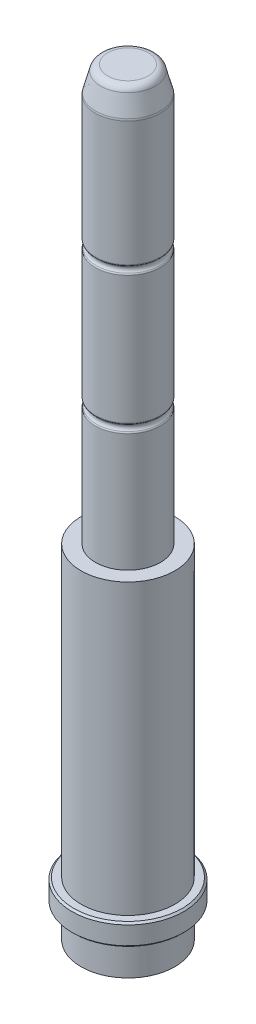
ISO-10303-21;
HEADER;
FILE_DESCRIPTION(('STEP AP214'),'2;1');
FILE_NAME('part.step','',(''),(''),'','','');
FILE_SCHEMA(('AUTOMOTIVE_DESIGN { 1 0 10303 214 1 1 1 1 }'));
ENDSEC;
DATA;
#1=APPLICATION_CONTEXT('core data for automotive mechanical design processes');
#2=APPLICATION_PROTOCOL_DEFINITION('international standard','automotive_design',2000,#1);
#3=PRODUCT_CONTEXT('',#1,'mechanical');
#4=PRODUCT('Part','Part','',(#3));
#5=PRODUCT_RELATED_PRODUCT_CATEGORY('part','',(#4));
#6=PRODUCT_DEFINITION_FORMATION('','',#4);
#7=PRODUCT_DEFINITION_CONTEXT('part definition',#1,'design');
#8=PRODUCT_DEFINITION('design','',#6,#7);
#9=PRODUCT_DEFINITION_SHAPE('','',#8);
#10=(LENGTH_UNIT() NAMED_UNIT(*) SI_UNIT(.MILLI.,.METRE.));
#11=(NAMED_UNIT(*) PLANE_ANGLE_UNIT() SI_UNIT($,.RADIAN.));
#12=(NAMED_UNIT(*) SI_UNIT($,.STERADIAN.) SOLID_ANGLE_UNIT());
#13=UNCERTAINTY_MEASURE_WITH_UNIT(LENGTH_MEASURE(1.E-05),#10,'distance_accuracy_value','');
#14=(GEOMETRIC_REPRESENTATION_CONTEXT(3) GLOBAL_UNCERTAINTY_ASSIGNED_CONTEXT((#13)) GLOBAL_UNIT_ASSIGNED_CONTEXT((#10,
#11,#12)) REPRESENTATION_CONTEXT('',''));
#15=CARTESIAN_POINT('',(0.,0.,0.));
#16=DIRECTION('',(0.,0.,1.));
#17=DIRECTION('',(1.,0.,0.));
#18=AXIS2_PLACEMENT_3D('',#15,#16,#17);
#19=CARTESIAN_POINT('',(0.,6.,0.));
#20=DIRECTION('',(0.,-1.,0.));
#21=DIRECTION('',(0.,0.,-1.));
#22=AXIS2_PLACEMENT_3D('',#19,#20,#21);
#23=CYLINDRICAL_SURFACE('',#22,15.5);
#24=CARTESIAN_POINT('',(0.,5.5,0.));
#25=DIRECTION('',(0.,1.,0.));
#26=DIRECTION('',(0.,0.,1.));
#27=AXIS2_PLACEMENT_3D('',#24,#25,#26);
#28=CIRCLE('',#27,15.5);
#29=CARTESIAN_POINT('',(0.,5.5,15.5));
#30=VERTEX_POINT('',#29);
#31=EDGE_CURVE('E22',#30,#30,#28,.F.);
#32=ORIENTED_EDGE('',*,*,#31,.T.);
#33=EDGE_LOOP('',(#32));
#34=FACE_BOUND('',#33,.T.);
#35=CARTESIAN_POINT('',(0.,0.499999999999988,0.));
#36=DIRECTION('',(0.,1.,0.));
#37=DIRECTION('',(0.,0.,1.));
#38=AXIS2_PLACEMENT_3D('',#35,#36,#37);
#39=CIRCLE('',#38,15.5);
#40=CARTESIAN_POINT('',(0.,0.499999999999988,15.5));
#41=VERTEX_POINT('',#40);
#42=EDGE_CURVE('E30',#41,#41,#39,.T.);
#43=ORIENTED_EDGE('',*,*,#42,.T.);
#44=EDGE_LOOP('',(#43));
#45=FACE_BOUND('',#44,.T.);
#46=ADVANCED_FACE('F14',(#34,#45),#23,.T.);
#47=CARTESIAN_POINT('',(0.,6.,0.));
#48=DIRECTION('',(0.,1.,0.));
#49=DIRECTION('',(0.,0.,1.));
#50=AXIS2_PLACEMENT_3D('',#47,#48,#49);
#51=PLANE('',#50);
#52=CARTESIAN_POINT('',(0.,6.,0.));
#53=DIRECTION('',(0.,1.,0.));
#54=DIRECTION('',(0.,0.,1.));
#55=AXIS2_PLACEMENT_3D('',#52,#53,#54);
#56=CIRCLE('',#55,15.);
#57=CARTESIAN_POINT('',(0.,6.,15.));
#58=VERTEX_POINT('',#57);
#59=EDGE_CURVE('E37',#58,#58,#56,.T.);
#60=ORIENTED_EDGE('',*,*,#59,.T.);
#61=EDGE_LOOP('',(#60));
#62=FACE_BOUND('',#61,.T.);
#63=CARTESIAN_POINT('',(0.,6.,0.));
#64=DIRECTION('',(0.,-1.,0.));
#65=DIRECTION('',(0.,0.,-1.));
#66=AXIS2_PLACEMENT_3D('',#63,#64,#65);
#67=CIRCLE('',#66,13.);
#68=CARTESIAN_POINT('',(0.,6.,-13.));
#69=VERTEX_POINT('',#68);
#70=EDGE_CURVE('E47',#69,#69,#67,.T.);
#71=ORIENTED_EDGE('',*,*,#70,.T.);
#72=EDGE_LOOP('',(#71));
#73=FACE_BOUND('',#72,.T.);
#74=ADVANCED_FACE('F125',(#62,#73),#51,.T.);
#75=CARTESIAN_POINT('',(0.,0.,0.));
#76=DIRECTION('',(0.,1.,0.));
#77=DIRECTION('',(0.,0.,1.));
#78=AXIS2_PLACEMENT_3D('',#75,#76,#77);
#79=PLANE('',#78);
#80=CARTESIAN_POINT('',(0.,0.,0.));
#81=DIRECTION('',(0.,1.,0.));
#82=DIRECTION('',(0.,0.,1.));
#83=AXIS2_PLACEMENT_3D('',#80,#81,#82);
#84=CIRCLE('',#83,15.);
#85=CARTESIAN_POINT('',(0.,0.,15.));
#86=VERTEX_POINT('',#85);
#87=EDGE_CURVE('E9',#86,#86,#84,.F.);
#88=ORIENTED_EDGE('',*,*,#87,.T.);
#89=EDGE_LOOP('',(#88));
#90=FACE_BOUND('',#89,.T.);
#91=CARTESIAN_POINT('',(0.,0.,0.));
#92=DIRECTION('',(0.,1.,0.));
#93=DIRECTION('',(0.,0.,1.));
#94=AXIS2_PLACEMENT_3D('',#91,#92,#93);
#95=CIRCLE('',#94,13.);
#96=CARTESIAN_POINT('',(0.,0.,13.));
#97=VERTEX_POINT('',#96);
#98=EDGE_CURVE('E104',#97,#97,#95,.T.);
#99=ORIENTED_EDGE('',*,*,#98,.T.);
#100=EDGE_LOOP('',(#99));
#101=FACE_BOUND('',#100,.T.);
#102=ADVANCED_FACE('F108',(#90,#101),#79,.F.);
#103=CARTESIAN_POINT('',(0.,86.,0.));
#104=DIRECTION('',(0.,-1.,0.));
#105=DIRECTION('',(0.,0.,-1.));
#106=AXIS2_PLACEMENT_3D('',#103,#104,#105);
#107=PLANE('',#106);
#108=CARTESIAN_POINT('',(0.,86.,0.));
#109=DIRECTION('',(0.,1.,0.));
#110=DIRECTION('',(0.,0.,1.));
#111=AXIS2_PLACEMENT_3D('',#108,#109,#110);
#112=CIRCLE('',#111,9.);
#113=CARTESIAN_POINT('',(0.,86.,8.99999999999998));
#114=VERTEX_POINT('',#113);
#115=EDGE_CURVE('E43',#114,#114,#112,.T.);
#116=ORIENTED_EDGE('',*,*,#115,.F.);
#117=EDGE_LOOP('',(#116));
#118=FACE_BOUND('',#117,.T.);
#119=CARTESIAN_POINT('',(0.,86.,0.));
#120=DIRECTION('',(0.,-1.,0.));
#121=DIRECTION('',(0.,0.,-1.));
#122=AXIS2_PLACEMENT_3D('',#119,#120,#121);
#123=CIRCLE('',#122,13.);
#124=CARTESIAN_POINT('',(0.,86.,-13.));
#125=VERTEX_POINT('',#124);
#126=EDGE_CURVE('E44',#125,#125,#123,.T.);
#127=ORIENTED_EDGE('',*,*,#126,.F.);
#128=EDGE_LOOP('',(#127));
#129=FACE_BOUND('',#128,.T.);
#130=ADVANCED_FACE('F134',(#118,#129),#107,.F.);
#131=CARTESIAN_POINT('',(0.,6.,0.));
#132=DIRECTION('',(0.,-1.,0.));
#133=DIRECTION('',(0.,0.,-1.));
#134=AXIS2_PLACEMENT_3D('',#131,#132,#133);
#135=CYLINDRICAL_SURFACE('',#134,13.);
#136=ORIENTED_EDGE('',*,*,#70,.F.);
#137=EDGE_LOOP('',(#136));
#138=FACE_BOUND('',#137,.T.);
#139=ORIENTED_EDGE('',*,*,#126,.T.);
#140=EDGE_LOOP('',(#139));
#141=FACE_BOUND('',#140,.T.);
#142=ADVANCED_FACE('F138',(#138,#141),#135,.T.);
#143=CARTESIAN_POINT('',(0.,201.,0.));
#144=DIRECTION('',(0.,1.,0.));
#145=DIRECTION('',(0.,0.,1.));
#146=AXIS2_PLACEMENT_3D('',#143,#144,#145);
#147=PLANE('',#146);
#148=CARTESIAN_POINT('',(0.,201.,0.));
#149=DIRECTION('',(0.,1.,0.));
#150=DIRECTION('',(0.,0.,1.));
#151=AXIS2_PLACEMENT_3D('',#148,#149,#150);
#152=CIRCLE('',#151,5.5897016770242);
#153=CARTESIAN_POINT('',(0.,201.,5.5897016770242));
#154=VERTEX_POINT('',#153);
#155=EDGE_CURVE('E51',#154,#154,#152,.T.);
#156=ORIENTED_EDGE('',*,*,#155,.T.);
#157=EDGE_LOOP('',(#156));
#158=FACE_BOUND('',#157,.T.);
#159=ADVANCED_FACE('F142',(#158),#147,.T.);
#160=CARTESIAN_POINT('',(0.,199.,0.));
#161=DIRECTION('',(0.,1.,0.));
#162=DIRECTION('',(0.,0.,1.));
#163=AXIS2_PLACEMENT_3D('',#160,#161,#162);
#164=TOROIDAL_SURFACE('',#163,5.5897016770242,2.);
#165=CARTESIAN_POINT('',(0.,199.517638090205,0.));
#166=DIRECTION('',(0.,1.,0.));
#167=DIRECTION('',(0.,0.,1.));
#168=AXIS2_PLACEMENT_3D('',#165,#166,#167);
#169=CIRCLE('',#168,7.52155332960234);
#170=CARTESIAN_POINT('',(0.,199.517638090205,7.52155332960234));
#171=VERTEX_POINT('',#170);
#172=EDGE_CURVE('E55',#171,#171,#169,.T.);
#173=ORIENTED_EDGE('',*,*,#172,.T.);
#174=EDGE_LOOP('',(#173));
#175=FACE_BOUND('',#174,.T.);
#176=ORIENTED_EDGE('',*,*,#155,.F.);
#177=EDGE_LOOP('',(#176));
#178=FACE_BOUND('',#177,.T.);
#179=ADVANCED_FACE('F146',(#175,#178),#164,.T.);
#180=CARTESIAN_POINT('',(0.,199.517638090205,0.));
#181=DIRECTION('',(0.,-1.,0.));
#182=DIRECTION('',(0.,0.,-1.));
#183=AXIS2_PLACEMENT_3D('',#180,#181,#182);
#184=CONICAL_SURFACE('',#183,7.52155332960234,0.261799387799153);
#185=CARTESIAN_POINT('',(0.,194.254333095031,0.));
#186=DIRECTION('',(0.,1.,0.));
#187=DIRECTION('',(0.,0.,1.));
#188=AXIS2_PLACEMENT_3D('',#185,#186,#187);
#189=CIRCLE('',#188,8.93185165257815);
#190=CARTESIAN_POINT('',(0.,194.254333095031,8.93185165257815));
#191=VERTEX_POINT('',#190);
#192=EDGE_CURVE('E58',#191,#191,#189,.T.);
#193=ORIENTED_EDGE('',*,*,#192,.T.);
#194=EDGE_LOOP('',(#193));
#195=FACE_BOUND('',#194,.T.);
#196=ORIENTED_EDGE('',*,*,#172,.F.);
#197=EDGE_LOOP('',(#196));
#198=FACE_BOUND('',#197,.T.);
#199=ADVANCED_FACE('F150',(#195,#198),#184,.T.);
#200=CARTESIAN_POINT('',(0.,193.736695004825,0.));
#201=DIRECTION('',(0.,1.,0.));
#202=DIRECTION('',(0.,0.,1.));
#203=AXIS2_PLACEMENT_3D('',#200,#201,#202);
#204=TOROIDAL_SURFACE('',#203,7.,2.);
#205=CARTESIAN_POINT('',(0.,193.736695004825,0.));
#206=DIRECTION('',(0.,1.,0.));
#207=DIRECTION('',(0.,0.,1.));
#208=AXIS2_PLACEMENT_3D('',#205,#206,#207);
#209=CIRCLE('',#208,9.);
#210=CARTESIAN_POINT('',(0.,193.736695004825,9.));
#211=VERTEX_POINT('',#210);
#212=EDGE_CURVE('E62',#211,#211,#209,.T.);
#213=ORIENTED_EDGE('',*,*,#212,.T.);
#214=EDGE_LOOP('',(#213));
#215=FACE_BOUND('',#214,.T.);
#216=ORIENTED_EDGE('',*,*,#192,.F.);
#217=EDGE_LOOP('',(#216));
#218=FACE_BOUND('',#217,.T.);
#219=ADVANCED_FACE('F154',(#215,#218),#204,.T.);
#220=CARTESIAN_POINT('',(0.,201.,0.));
#221=DIRECTION('',(0.,1.,0.));
#222=DIRECTION('',(0.,0.,1.));
#223=AXIS2_PLACEMENT_3D('',#220,#221,#222);
#224=CYLINDRICAL_SURFACE('',#223,9.);
#225=CARTESIAN_POINT('',(0.,159.272019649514,0.));
#226=DIRECTION('',(0.,1.,0.));
#227=DIRECTION('',(0.,0.,1.));
#228=AXIS2_PLACEMENT_3D('',#225,#226,#227);
#229=CIRCLE('',#228,9.);
#230=CARTESIAN_POINT('',(0.,159.272019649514,9.));
#231=VERTEX_POINT('',#230);
#232=EDGE_CURVE('E66',#231,#231,#229,.T.);
#233=ORIENTED_EDGE('',*,*,#232,.T.);
#234=EDGE_LOOP('',(#233));
#235=FACE_BOUND('',#234,.T.);
#236=ORIENTED_EDGE('',*,*,#212,.F.);
#237=EDGE_LOOP('',(#236));
#238=FACE_BOUND('',#237,.T.);
#239=ADVANCED_FACE('F158',(#235,#238),#224,.T.);
#240=CARTESIAN_POINT('',(0.,159.272019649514,0.));
#241=DIRECTION('',(0.,1.,0.));
#242=DIRECTION('',(0.,0.,1.));
#243=AXIS2_PLACEMENT_3D('',#240,#241,#242);
#244=TOROIDAL_SURFACE('',#243,8.5,0.5);
#245=CARTESIAN_POINT('',(0.,158.878943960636,0.));
#246=DIRECTION('',(0.,1.,0.));
#247=DIRECTION('',(0.,0.,1.));
#248=AXIS2_PLACEMENT_3D('',#245,#246,#247);
#249=CIRCLE('',#248,8.80901699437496);
#250=CARTESIAN_POINT('',(0.,158.878943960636,8.80901699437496));
#251=VERTEX_POINT('',#250);
#252=EDGE_CURVE('E70',#251,#251,#249,.T.);
#253=ORIENTED_EDGE('',*,*,#252,.T.);
#254=EDGE_LOOP('',(#253));
#255=FACE_BOUND('',#254,.T.);
#256=ORIENTED_EDGE('',*,*,#232,.F.);
#257=EDGE_LOOP('',(#256));
#258=FACE_BOUND('',#257,.T.);
#259=ADVANCED_FACE('F162',(#255,#258),#244,.T.);
#260=CARTESIAN_POINT('',(0.,158.,0.));
#261=DIRECTION('',(0.,1.,0.));
#262=DIRECTION('',(0.,0.,1.));
#263=AXIS2_PLACEMENT_3D('',#260,#261,#262);
#264=TOROIDAL_SURFACE('',#263,9.5,1.11803398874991);
#265=CARTESIAN_POINT('',(0.,157.121056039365,0.));
#266=DIRECTION('',(0.,1.,0.));
#267=DIRECTION('',(0.,0.,1.));
#268=AXIS2_PLACEMENT_3D('',#265,#266,#267);
#269=CIRCLE('',#268,8.80901699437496);
#270=CARTESIAN_POINT('',(0.,157.121056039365,8.80901699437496));
#271=VERTEX_POINT('',#270);
#272=EDGE_CURVE('E74',#271,#271,#269,.T.);
#273=ORIENTED_EDGE('',*,*,#272,.T.);
#274=EDGE_LOOP('',(#273));
#275=FACE_BOUND('',#274,.T.);
#276=ORIENTED_EDGE('',*,*,#252,.F.);
#277=EDGE_LOOP('',(#276));
#278=FACE_BOUND('',#277,.T.);
#279=ADVANCED_FACE('F166',(#275,#278),#264,.F.);
#280=CARTESIAN_POINT('',(0.,156.727980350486,0.));
#281=DIRECTION('',(0.,1.,0.));
#282=DIRECTION('',(0.,0.,1.));
#283=AXIS2_PLACEMENT_3D('',#280,#281,#282);
#284=TOROIDAL_SURFACE('',#283,8.5,0.5);
#285=CARTESIAN_POINT('',(0.,156.727980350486,0.));
#286=DIRECTION('',(0.,1.,0.));
#287=DIRECTION('',(0.,0.,1.));
#288=AXIS2_PLACEMENT_3D('',#285,#286,#287);
#289=CIRCLE('',#288,9.);
#290=CARTESIAN_POINT('',(0.,156.727980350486,8.99999999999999));
#291=VERTEX_POINT('',#290);
#292=EDGE_CURVE('E78',#291,#291,#289,.T.);
#293=ORIENTED_EDGE('',*,*,#292,.T.);
#294=EDGE_LOOP('',(#293));
#295=FACE_BOUND('',#294,.T.);
#296=ORIENTED_EDGE('',*,*,#272,.F.);
#297=EDGE_LOOP('',(#296));
#298=FACE_BOUND('',#297,.T.);
#299=ADVANCED_FACE('F170',(#295,#298),#284,.T.);
#300=CARTESIAN_POINT('',(0.,201.,0.));
#301=DIRECTION('',(0.,1.,0.));
#302=DIRECTION('',(0.,0.,1.));
#303=AXIS2_PLACEMENT_3D('',#300,#301,#302);
#304=CYLINDRICAL_SURFACE('',#303,9.);
#305=CARTESIAN_POINT('',(0.,121.272019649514,0.));
#306=DIRECTION('',(0.,1.,0.));
#307=DIRECTION('',(0.,0.,1.));
#308=AXIS2_PLACEMENT_3D('',#305,#306,#307);
#309=CIRCLE('',#308,9.);
#310=CARTESIAN_POINT('',(0.,121.272019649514,8.99999999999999));
#311=VERTEX_POINT('',#310);
#312=EDGE_CURVE('E82',#311,#311,#309,.T.);
#313=ORIENTED_EDGE('',*,*,#312,.T.);
#314=EDGE_LOOP('',(#313));
#315=FACE_BOUND('',#314,.T.);
#316=ORIENTED_EDGE('',*,*,#292,.F.);
#317=EDGE_LOOP('',(#316));
#318=FACE_BOUND('',#317,.T.);
#319=ADVANCED_FACE('F174',(#315,#318),#304,.T.);
#320=CARTESIAN_POINT('',(0.,121.272019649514,0.));
#321=DIRECTION('',(0.,1.,0.));
#322=DIRECTION('',(0.,0.,1.));
#323=AXIS2_PLACEMENT_3D('',#320,#321,#322);
#324=TOROIDAL_SURFACE('',#323,8.5,0.5);
#325=CARTESIAN_POINT('',(0.,120.878943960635,0.));
#326=DIRECTION('',(0.,1.,0.));
#327=DIRECTION('',(0.,0.,1.));
#328=AXIS2_PLACEMENT_3D('',#325,#326,#327);
#329=CIRCLE('',#328,8.80901699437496);
#330=CARTESIAN_POINT('',(0.,120.878943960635,8.80901699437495));
#331=VERTEX_POINT('',#330);
#332=EDGE_CURVE('E85',#331,#331,#329,.T.);
#333=ORIENTED_EDGE('',*,*,#332,.T.);
#334=EDGE_LOOP('',(#333));
#335=FACE_BOUND('',#334,.T.);
#336=ORIENTED_EDGE('',*,*,#312,.F.);
#337=EDGE_LOOP('',(#336));
#338=FACE_BOUND('',#337,.T.);
#339=ADVANCED_FACE('F178',(#335,#338),#324,.T.);
#340=CARTESIAN_POINT('',(0.,120.,0.));
#341=DIRECTION('',(0.,1.,0.));
#342=DIRECTION('',(0.,0.,1.));
#343=AXIS2_PLACEMENT_3D('',#340,#341,#342);
#344=TOROIDAL_SURFACE('',#343,9.5,1.11803398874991);
#345=CARTESIAN_POINT('',(0.,119.121056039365,0.));
#346=DIRECTION('',(0.,1.,0.));
#347=DIRECTION('',(0.,0.,1.));
#348=AXIS2_PLACEMENT_3D('',#345,#346,#347);
#349=CIRCLE('',#348,8.80901699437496);
#350=CARTESIAN_POINT('',(0.,119.121056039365,8.80901699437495));
#351=VERTEX_POINT('',#350);
#352=EDGE_CURVE('E89',#351,#351,#349,.T.);
#353=ORIENTED_EDGE('',*,*,#352,.T.);
#354=EDGE_LOOP('',(#353));
#355=FACE_BOUND('',#354,.T.);
#356=ORIENTED_EDGE('',*,*,#332,.F.);
#357=EDGE_LOOP('',(#356));
#358=FACE_BOUND('',#357,.T.);
#359=ADVANCED_FACE('F182',(#355,#358),#344,.F.);
#360=CARTESIAN_POINT('',(0.,118.727980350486,0.));
#361=DIRECTION('',(0.,1.,0.));
#362=DIRECTION('',(0.,0.,1.));
#363=AXIS2_PLACEMENT_3D('',#360,#361,#362);
#364=TOROIDAL_SURFACE('',#363,8.5,0.5);
#365=CARTESIAN_POINT('',(0.,118.727980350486,0.));
#366=DIRECTION('',(0.,1.,0.));
#367=DIRECTION('',(0.,0.,1.));
#368=AXIS2_PLACEMENT_3D('',#365,#366,#367);
#369=CIRCLE('',#368,9.);
#370=CARTESIAN_POINT('',(0.,118.727980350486,8.99999999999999));
#371=VERTEX_POINT('',#370);
#372=EDGE_CURVE('E93',#371,#371,#369,.T.);
#373=ORIENTED_EDGE('',*,*,#372,.T.);
#374=EDGE_LOOP('',(#373));
#375=FACE_BOUND('',#374,.T.);
#376=ORIENTED_EDGE('',*,*,#352,.F.);
#377=EDGE_LOOP('',(#376));
#378=FACE_BOUND('',#377,.T.);
#379=ADVANCED_FACE('F186',(#375,#378),#364,.T.);
#380=CARTESIAN_POINT('',(0.,201.,0.));
#381=DIRECTION('',(0.,1.,0.));
#382=DIRECTION('',(0.,0.,1.));
#383=AXIS2_PLACEMENT_3D('',#380,#381,#382);
#384=CYLINDRICAL_SURFACE('',#383,9.);
#385=ORIENTED_EDGE('',*,*,#115,.T.);
#386=EDGE_LOOP('',(#385));
#387=FACE_BOUND('',#386,.T.);
#388=ORIENTED_EDGE('',*,*,#372,.F.);
#389=EDGE_LOOP('',(#388));
#390=FACE_BOUND('',#389,.T.);
#391=ADVANCED_FACE('F121',(#387,#390),#384,.T.);
#392=CARTESIAN_POINT('',(0.,-9.,0.));
#393=DIRECTION('',(0.,-1.,0.));
#394=DIRECTION('',(0.,0.,-1.));
#395=AXIS2_PLACEMENT_3D('',#392,#393,#394);
#396=PLANE('',#395);
#397=CARTESIAN_POINT('',(0.,-9.,0.));
#398=DIRECTION('',(0.,1.,0.));
#399=DIRECTION('',(0.,0.,1.));
#400=AXIS2_PLACEMENT_3D('',#397,#398,#399);
#401=CIRCLE('',#400,13.);
#402=CARTESIAN_POINT('',(0.,-9.,13.));
#403=VERTEX_POINT('',#402);
#404=EDGE_CURVE('E97',#403,#403,#401,.T.);
#405=ORIENTED_EDGE('',*,*,#404,.F.);
#406=EDGE_LOOP('',(#405));
#407=FACE_BOUND('',#406,.T.);
#408=ADVANCED_FACE('F113',(#407),#396,.T.);
#409=CARTESIAN_POINT('',(0.,0.,0.));
#410=DIRECTION('',(0.,1.,0.));
#411=DIRECTION('',(0.,0.,1.));
#412=AXIS2_PLACEMENT_3D('',#409,#410,#411);
#413=CYLINDRICAL_SURFACE('',#412,13.);
#414=ORIENTED_EDGE('',*,*,#404,.T.);
#415=EDGE_LOOP('',(#414));
#416=FACE_BOUND('',#415,.T.);
#417=ORIENTED_EDGE('',*,*,#98,.F.);
#418=EDGE_LOOP('',(#417));
#419=FACE_BOUND('',#418,.T.);
#420=ADVANCED_FACE('F110',(#416,#419),#413,.T.);
#421=CARTESIAN_POINT('',(0.,6.,0.));
#422=DIRECTION('',(0.,-1.,0.));
#423=DIRECTION('',(0.,0.,-1.));
#424=AXIS2_PLACEMENT_3D('',#421,#422,#423);
#425=CONICAL_SURFACE('',#424,15.,0.78539816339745);
#426=ORIENTED_EDGE('',*,*,#31,.F.);
#427=EDGE_LOOP('',(#426));
#428=FACE_BOUND('',#427,.T.);
#429=ORIENTED_EDGE('',*,*,#59,.F.);
#430=EDGE_LOOP('',(#429));
#431=FACE_BOUND('',#430,.T.);
#432=ADVANCED_FACE('F112',(#428,#431),#425,.T.);
#433=CARTESIAN_POINT('',(0.,0.499999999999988,0.));
#434=DIRECTION('',(0.,1.,0.));
#435=DIRECTION('',(0.,0.,1.));
#436=AXIS2_PLACEMENT_3D('',#433,#434,#435);
#437=CONICAL_SURFACE('',#436,15.5,0.785398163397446);
#438=ORIENTED_EDGE('',*,*,#87,.F.);
#439=EDGE_LOOP('',(#438));
#440=FACE_BOUND('',#439,.T.);
#441=ORIENTED_EDGE('',*,*,#42,.F.);
#442=EDGE_LOOP('',(#441));
#443=FACE_BOUND('',#442,.T.);
#444=ADVANCED_FACE('F16',(#440,#443),#437,.T.);
#445=CLOSED_SHELL('',(#46,#74,#102,#130,#142,#159,#179,#199,#219,#239,#259,#279,#299,#319,#339,
#359,#379,#391,#408,#420,#432,#444));
#446=MANIFOLD_SOLID_BREP('B1',#445);
#447=ADVANCED_BREP_SHAPE_REPRESENTATION('',(#18,#446),#14);
#448=SHAPE_DEFINITION_REPRESENTATION(#9,#447);
ENDSEC;
END-ISO-10303-21;
